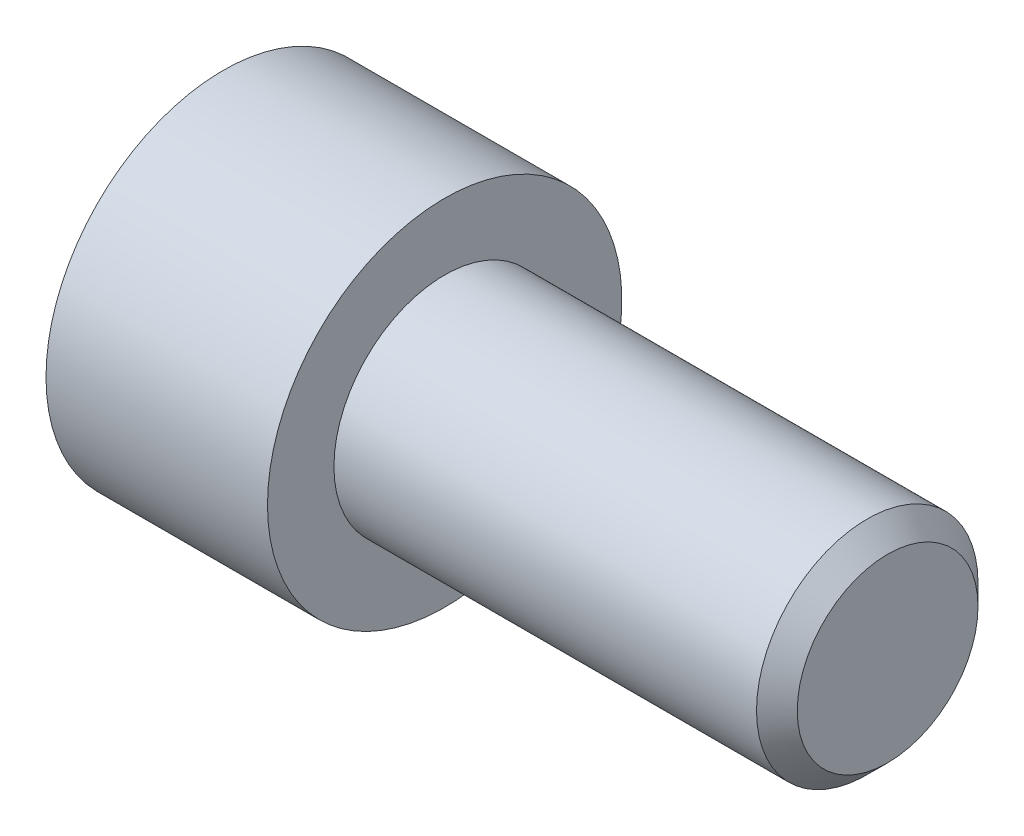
ISO-10303-21;
HEADER;
FILE_DESCRIPTION(('STEP AP214'),'2;1');
FILE_NAME('part.step','',(''),(''),'','','');
FILE_SCHEMA(('AUTOMOTIVE_DESIGN { 1 0 10303 214 1 1 1 1 }'));
ENDSEC;
DATA;
#1=APPLICATION_CONTEXT('core data for automotive mechanical design processes');
#2=APPLICATION_PROTOCOL_DEFINITION('international standard','automotive_design',2000,#1);
#3=PRODUCT_CONTEXT('',#1,'mechanical');
#4=PRODUCT('Part','Part','',(#3));
#5=PRODUCT_RELATED_PRODUCT_CATEGORY('part','',(#4));
#6=PRODUCT_DEFINITION_FORMATION('','',#4);
#7=PRODUCT_DEFINITION_CONTEXT('part definition',#1,'design');
#8=PRODUCT_DEFINITION('design','',#6,#7);
#9=PRODUCT_DEFINITION_SHAPE('','',#8);
#10=(LENGTH_UNIT() NAMED_UNIT(*) SI_UNIT(.MILLI.,.METRE.));
#11=(NAMED_UNIT(*) PLANE_ANGLE_UNIT() SI_UNIT($,.RADIAN.));
#12=(NAMED_UNIT(*) SI_UNIT($,.STERADIAN.) SOLID_ANGLE_UNIT());
#13=UNCERTAINTY_MEASURE_WITH_UNIT(LENGTH_MEASURE(1.E-05),#10,'distance_accuracy_value','');
#14=(GEOMETRIC_REPRESENTATION_CONTEXT(3) GLOBAL_UNCERTAINTY_ASSIGNED_CONTEXT((#13)) GLOBAL_UNIT_ASSIGNED_CONTEXT((#10,
#11,#12)) REPRESENTATION_CONTEXT('',''));
#15=CARTESIAN_POINT('',(0.,0.,0.));
#16=DIRECTION('',(0.,0.,1.));
#17=DIRECTION('',(1.,0.,0.));
#18=AXIS2_PLACEMENT_3D('',#15,#16,#17);
#19=CARTESIAN_POINT('',(-5.,2.3094010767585,4.));
#20=DIRECTION('',(1.,0.,0.));
#21=DIRECTION('',(0.,0.,-1.));
#22=AXIS2_PLACEMENT_3D('',#19,#20,#21);
#23=PLANE('',#22);
#24=DIRECTION('',(0.,-0.5,0.866025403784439));
#25=VECTOR('',#24,1.);
#26=CARTESIAN_POINT('',(-5.,4.61880215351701,0.));
#27=LINE('',#26,#25);
#28=CARTESIAN_POINT('',(-5.,4.61880215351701,0.));
#29=VERTEX_POINT('',#28);
#30=CARTESIAN_POINT('',(-5.,2.3094010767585,4.));
#31=VERTEX_POINT('',#30);
#32=EDGE_CURVE('E182',#29,#31,#27,.T.);
#33=ORIENTED_EDGE('',*,*,#32,.F.);
#34=DIRECTION('',(0.,0.5,0.866025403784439));
#35=VECTOR('',#34,1.);
#36=CARTESIAN_POINT('',(-5.,2.3094010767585,-4.));
#37=LINE('',#36,#35);
#38=CARTESIAN_POINT('',(-5.,2.3094010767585,-4.));
#39=VERTEX_POINT('',#38);
#40=EDGE_CURVE('E54',#39,#29,#37,.T.);
#41=ORIENTED_EDGE('',*,*,#40,.F.);
#42=DIRECTION('',(0.,1.,0.));
#43=VECTOR('',#42,1.);
#44=CARTESIAN_POINT('',(-5.,-2.3094010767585,-4.));
#45=LINE('',#44,#43);
#46=CARTESIAN_POINT('',(-5.,-2.3094010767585,-4.));
#47=VERTEX_POINT('',#46);
#48=EDGE_CURVE('E174',#47,#39,#45,.T.);
#49=ORIENTED_EDGE('',*,*,#48,.F.);
#50=DIRECTION('',(0.,0.5,-0.866025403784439));
#51=VECTOR('',#50,1.);
#52=CARTESIAN_POINT('',(-5.,-4.61880215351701,0.));
#53=LINE('',#52,#51);
#54=CARTESIAN_POINT('',(-5.,-4.61880215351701,0.));
#55=VERTEX_POINT('',#54);
#56=EDGE_CURVE('E176',#55,#47,#53,.T.);
#57=ORIENTED_EDGE('',*,*,#56,.F.);
#58=DIRECTION('',(0.,-0.5,-0.866025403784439));
#59=VECTOR('',#58,1.);
#60=CARTESIAN_POINT('',(-5.,-2.3094010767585,4.));
#61=LINE('',#60,#59);
#62=CARTESIAN_POINT('',(-5.,-2.3094010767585,4.));
#63=VERTEX_POINT('',#62);
#64=EDGE_CURVE('E178',#63,#55,#61,.T.);
#65=ORIENTED_EDGE('',*,*,#64,.F.);
#66=DIRECTION('',(0.,-1.,0.));
#67=VECTOR('',#66,1.);
#68=CARTESIAN_POINT('',(-5.,2.3094010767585,4.));
#69=LINE('',#68,#67);
#70=EDGE_CURVE('E180',#31,#63,#69,.T.);
#71=ORIENTED_EDGE('',*,*,#70,.F.);
#72=EDGE_LOOP('',(#33,#41,#49,#57,#65,#71));
#73=FACE_BOUND('',#72,.T.);
#74=CARTESIAN_POINT('',(-5.,0.,0.));
#75=DIRECTION('',(-1.,0.,0.));
#76=DIRECTION('',(0.,-1.,0.));
#77=AXIS2_PLACEMENT_3D('',#74,#75,#76);
#78=CIRCLE('',#77,3.99);
#79=CARTESIAN_POINT('',(-5.,-3.99,0.));
#80=VERTEX_POINT('',#79);
#81=EDGE_CURVE('E201',#80,#80,#78,.T.);
#82=ORIENTED_EDGE('',*,*,#81,.F.);
#83=EDGE_LOOP('',(#82));
#84=FACE_BOUND('',#83,.T.);
#85=ADVANCED_FACE('F32',(#73,#84),#23,.F.);
#86=CARTESIAN_POINT('',(-10.,0.,0.));
#87=DIRECTION('',(1.,0.,0.));
#88=DIRECTION('',(0.,0.,-1.));
#89=AXIS2_PLACEMENT_3D('',#86,#87,#88);
#90=PLANE('',#89);
#91=CARTESIAN_POINT('',(-10.,0.,0.));
#92=DIRECTION('',(-1.,0.,0.));
#93=DIRECTION('',(0.,0.,1.));
#94=AXIS2_PLACEMENT_3D('',#91,#92,#93);
#95=CIRCLE('',#94,8.);
#96=CARTESIAN_POINT('',(-10.,0.,8.));
#97=VERTEX_POINT('',#96);
#98=EDGE_CURVE('E11',#97,#97,#95,.T.);
#99=ORIENTED_EDGE('',*,*,#98,.T.);
#100=EDGE_LOOP('',(#99));
#101=FACE_BOUND('',#100,.T.);
#102=DIRECTION('',(0.,-0.5,0.866025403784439));
#103=VECTOR('',#102,1.);
#104=CARTESIAN_POINT('',(-10.,4.61880215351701,0.));
#105=LINE('',#104,#103);
#106=CARTESIAN_POINT('',(-10.,4.61880215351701,0.));
#107=VERTEX_POINT('',#106);
#108=CARTESIAN_POINT('',(-10.,2.3094010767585,4.));
#109=VERTEX_POINT('',#108);
#110=EDGE_CURVE('E47',#107,#109,#105,.T.);
#111=ORIENTED_EDGE('',*,*,#110,.T.);
#112=DIRECTION('',(0.,-1.,0.));
#113=VECTOR('',#112,1.);
#114=CARTESIAN_POINT('',(-10.,2.3094010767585,4.));
#115=LINE('',#114,#113);
#116=CARTESIAN_POINT('',(-10.,-2.3094010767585,4.));
#117=VERTEX_POINT('',#116);
#118=EDGE_CURVE('E197',#109,#117,#115,.T.);
#119=ORIENTED_EDGE('',*,*,#118,.T.);
#120=DIRECTION('',(0.,-0.5,-0.866025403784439));
#121=VECTOR('',#120,1.);
#122=CARTESIAN_POINT('',(-10.,-2.3094010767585,4.));
#123=LINE('',#122,#121);
#124=CARTESIAN_POINT('',(-10.,-4.61880215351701,0.));
#125=VERTEX_POINT('',#124);
#126=EDGE_CURVE('E194',#117,#125,#123,.T.);
#127=ORIENTED_EDGE('',*,*,#126,.T.);
#128=DIRECTION('',(0.,0.5,-0.866025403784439));
#129=VECTOR('',#128,1.);
#130=CARTESIAN_POINT('',(-10.,-4.61880215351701,0.));
#131=LINE('',#130,#129);
#132=CARTESIAN_POINT('',(-10.,-2.3094010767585,-4.));
#133=VERTEX_POINT('',#132);
#134=EDGE_CURVE('E191',#125,#133,#131,.T.);
#135=ORIENTED_EDGE('',*,*,#134,.T.);
#136=DIRECTION('',(0.,1.,0.));
#137=VECTOR('',#136,1.);
#138=CARTESIAN_POINT('',(-10.,-2.3094010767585,-4.));
#139=LINE('',#138,#137);
#140=CARTESIAN_POINT('',(-10.,2.3094010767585,-4.));
#141=VERTEX_POINT('',#140);
#142=EDGE_CURVE('E188',#133,#141,#139,.T.);
#143=ORIENTED_EDGE('',*,*,#142,.T.);
#144=DIRECTION('',(0.,0.5,0.866025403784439));
#145=VECTOR('',#144,1.);
#146=CARTESIAN_POINT('',(-10.,2.3094010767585,-4.));
#147=LINE('',#146,#145);
#148=EDGE_CURVE('E185',#141,#107,#147,.T.);
#149=ORIENTED_EDGE('',*,*,#148,.T.);
#150=EDGE_LOOP('',(#111,#119,#127,#135,#143,#149));
#151=FACE_BOUND('',#150,.T.);
#152=ADVANCED_FACE('F34',(#101,#151),#90,.F.);
#153=CARTESIAN_POINT('',(20.,0.,0.));
#154=DIRECTION('',(-1.,0.,0.));
#155=DIRECTION('',(0.,0.,1.));
#156=AXIS2_PLACEMENT_3D('',#153,#154,#155);
#157=CYLINDRICAL_SURFACE('',#156,8.);
#158=ORIENTED_EDGE('',*,*,#98,.F.);
#159=EDGE_LOOP('',(#158));
#160=FACE_BOUND('',#159,.T.);
#161=CARTESIAN_POINT('',(0.,0.,0.));
#162=DIRECTION('',(-1.,0.,0.));
#163=DIRECTION('',(0.,0.,1.));
#164=AXIS2_PLACEMENT_3D('',#161,#162,#163);
#165=CIRCLE('',#164,8.);
#166=CARTESIAN_POINT('',(0.,0.,8.));
#167=VERTEX_POINT('',#166);
#168=EDGE_CURVE('E40',#167,#167,#165,.T.);
#169=ORIENTED_EDGE('',*,*,#168,.T.);
#170=EDGE_LOOP('',(#169));
#171=FACE_BOUND('',#170,.T.);
#172=ADVANCED_FACE('F105',(#160,#171),#157,.T.);
#173=CARTESIAN_POINT('',(0.,8.,0.));
#174=DIRECTION('',(-1.,0.,0.));
#175=DIRECTION('',(0.,0.,1.));
#176=AXIS2_PLACEMENT_3D('',#173,#174,#175);
#177=PLANE('',#176);
#178=ORIENTED_EDGE('',*,*,#168,.F.);
#179=EDGE_LOOP('',(#178));
#180=FACE_BOUND('',#179,.T.);
#181=CARTESIAN_POINT('',(0.,0.,0.));
#182=DIRECTION('',(-1.,0.,0.));
#183=DIRECTION('',(0.,0.,1.));
#184=AXIS2_PLACEMENT_3D('',#181,#182,#183);
#185=CIRCLE('',#184,5.);
#186=CARTESIAN_POINT('',(0.,0.,5.));
#187=VERTEX_POINT('',#186);
#188=EDGE_CURVE('E151',#187,#187,#185,.T.);
#189=ORIENTED_EDGE('',*,*,#188,.T.);
#190=EDGE_LOOP('',(#189));
#191=FACE_BOUND('',#190,.T.);
#192=ADVANCED_FACE('F139',(#180,#191),#177,.F.);
#193=CARTESIAN_POINT('',(20.,0.,0.));
#194=DIRECTION('',(-1.,0.,0.));
#195=DIRECTION('',(0.,0.,1.));
#196=AXIS2_PLACEMENT_3D('',#193,#194,#195);
#197=CYLINDRICAL_SURFACE('',#196,5.);
#198=ORIENTED_EDGE('',*,*,#188,.F.);
#199=EDGE_LOOP('',(#198));
#200=FACE_BOUND('',#199,.T.);
#201=CARTESIAN_POINT('',(19.08,0.,0.));
#202=DIRECTION('',(-1.,0.,0.));
#203=DIRECTION('',(0.,0.,1.));
#204=AXIS2_PLACEMENT_3D('',#201,#202,#203);
#205=CIRCLE('',#204,5.);
#206=CARTESIAN_POINT('',(19.08,0.,5.));
#207=VERTEX_POINT('',#206);
#208=EDGE_CURVE('E153',#207,#207,#205,.T.);
#209=ORIENTED_EDGE('',*,*,#208,.T.);
#210=EDGE_LOOP('',(#209));
#211=FACE_BOUND('',#210,.T.);
#212=ADVANCED_FACE('F135',(#200,#211),#197,.T.);
#213=CARTESIAN_POINT('',(20.,0.,0.));
#214=DIRECTION('',(-1.,0.,0.));
#215=DIRECTION('',(0.,0.,1.));
#216=AXIS2_PLACEMENT_3D('',#213,#214,#215);
#217=CONICAL_SURFACE('',#216,4.08,0.785398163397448);
#218=ORIENTED_EDGE('',*,*,#208,.F.);
#219=EDGE_LOOP('',(#218));
#220=FACE_BOUND('',#219,.T.);
#221=CARTESIAN_POINT('',(20.,0.,0.));
#222=DIRECTION('',(-1.,0.,0.));
#223=DIRECTION('',(0.,0.,1.));
#224=AXIS2_PLACEMENT_3D('',#221,#222,#223);
#225=CIRCLE('',#224,4.08);
#226=CARTESIAN_POINT('',(20.,0.,4.08));
#227=VERTEX_POINT('',#226);
#228=EDGE_CURVE('E158',#227,#227,#225,.T.);
#229=ORIENTED_EDGE('',*,*,#228,.T.);
#230=EDGE_LOOP('',(#229));
#231=FACE_BOUND('',#230,.T.);
#232=ADVANCED_FACE('F131',(#220,#231),#217,.T.);
#233=CARTESIAN_POINT('',(20.,4.08,0.));
#234=DIRECTION('',(-1.,0.,0.));
#235=DIRECTION('',(0.,0.,1.));
#236=AXIS2_PLACEMENT_3D('',#233,#234,#235);
#237=PLANE('',#236);
#238=ORIENTED_EDGE('',*,*,#228,.F.);
#239=EDGE_LOOP('',(#238));
#240=FACE_BOUND('',#239,.T.);
#241=ADVANCED_FACE('F128',(#240),#237,.F.);
#242=CARTESIAN_POINT('',(-5.,4.61880215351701,0.));
#243=DIRECTION('',(0.,-0.866025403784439,-0.5));
#244=DIRECTION('',(0.,0.5,-0.866025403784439));
#245=AXIS2_PLACEMENT_3D('',#242,#243,#244);
#246=PLANE('',#245);
#247=ORIENTED_EDGE('',*,*,#110,.F.);
#248=DIRECTION('',(-1.,0.,0.));
#249=VECTOR('',#248,1.);
#250=CARTESIAN_POINT('',(-5.,4.61880215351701,0.));
#251=LINE('',#250,#249);
#252=EDGE_CURVE('E171',#29,#107,#251,.T.);
#253=ORIENTED_EDGE('',*,*,#252,.F.);
#254=ORIENTED_EDGE('',*,*,#32,.T.);
#255=DIRECTION('',(-1.,0.,0.));
#256=VECTOR('',#255,1.);
#257=CARTESIAN_POINT('',(-5.,2.3094010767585,4.));
#258=LINE('',#257,#256);
#259=EDGE_CURVE('E161',#31,#109,#258,.T.);
#260=ORIENTED_EDGE('',*,*,#259,.T.);
#261=EDGE_LOOP('',(#247,#253,#254,#260));
#262=FACE_BOUND('',#261,.T.);
#263=ADVANCED_FACE('F124',(#262),#246,.T.);
#264=CARTESIAN_POINT('',(-5.,2.3094010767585,4.));
#265=DIRECTION('',(0.,0.,-1.));
#266=DIRECTION('',(-1.,0.,0.));
#267=AXIS2_PLACEMENT_3D('',#264,#265,#266);
#268=PLANE('',#267);
#269=ORIENTED_EDGE('',*,*,#118,.F.);
#270=ORIENTED_EDGE('',*,*,#259,.F.);
#271=ORIENTED_EDGE('',*,*,#70,.T.);
#272=DIRECTION('',(-1.,0.,0.));
#273=VECTOR('',#272,1.);
#274=CARTESIAN_POINT('',(-5.,-2.3094010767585,4.));
#275=LINE('',#274,#273);
#276=EDGE_CURVE('E163',#63,#117,#275,.T.);
#277=ORIENTED_EDGE('',*,*,#276,.T.);
#278=EDGE_LOOP('',(#269,#270,#271,#277));
#279=FACE_BOUND('',#278,.T.);
#280=ADVANCED_FACE('F120',(#279),#268,.T.);
#281=CARTESIAN_POINT('',(-5.,-2.3094010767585,4.));
#282=DIRECTION('',(0.,0.866025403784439,-0.5));
#283=DIRECTION('',(0.,0.5,0.866025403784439));
#284=AXIS2_PLACEMENT_3D('',#281,#282,#283);
#285=PLANE('',#284);
#286=ORIENTED_EDGE('',*,*,#126,.F.);
#287=ORIENTED_EDGE('',*,*,#276,.F.);
#288=ORIENTED_EDGE('',*,*,#64,.T.);
#289=DIRECTION('',(-1.,0.,0.));
#290=VECTOR('',#289,1.);
#291=CARTESIAN_POINT('',(-5.,-4.61880215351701,0.));
#292=LINE('',#291,#290);
#293=EDGE_CURVE('E165',#55,#125,#292,.T.);
#294=ORIENTED_EDGE('',*,*,#293,.T.);
#295=EDGE_LOOP('',(#286,#287,#288,#294));
#296=FACE_BOUND('',#295,.T.);
#297=ADVANCED_FACE('F116',(#296),#285,.T.);
#298=CARTESIAN_POINT('',(-5.,-4.61880215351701,0.));
#299=DIRECTION('',(0.,0.866025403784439,0.5));
#300=DIRECTION('',(0.,-0.5,0.866025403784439));
#301=AXIS2_PLACEMENT_3D('',#298,#299,#300);
#302=PLANE('',#301);
#303=ORIENTED_EDGE('',*,*,#134,.F.);
#304=ORIENTED_EDGE('',*,*,#293,.F.);
#305=ORIENTED_EDGE('',*,*,#56,.T.);
#306=DIRECTION('',(-1.,0.,0.));
#307=VECTOR('',#306,1.);
#308=CARTESIAN_POINT('',(-5.,-2.3094010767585,-4.));
#309=LINE('',#308,#307);
#310=EDGE_CURVE('E167',#47,#133,#309,.T.);
#311=ORIENTED_EDGE('',*,*,#310,.T.);
#312=EDGE_LOOP('',(#303,#304,#305,#311));
#313=FACE_BOUND('',#312,.T.);
#314=ADVANCED_FACE('F112',(#313),#302,.T.);
#315=CARTESIAN_POINT('',(-5.,-2.3094010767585,-4.));
#316=DIRECTION('',(0.,0.,1.));
#317=DIRECTION('',(1.,0.,0.));
#318=AXIS2_PLACEMENT_3D('',#315,#316,#317);
#319=PLANE('',#318);
#320=ORIENTED_EDGE('',*,*,#142,.F.);
#321=ORIENTED_EDGE('',*,*,#310,.F.);
#322=ORIENTED_EDGE('',*,*,#48,.T.);
#323=DIRECTION('',(-1.,0.,0.));
#324=VECTOR('',#323,1.);
#325=CARTESIAN_POINT('',(-5.,2.3094010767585,-4.));
#326=LINE('',#325,#324);
#327=EDGE_CURVE('E169',#39,#141,#326,.T.);
#328=ORIENTED_EDGE('',*,*,#327,.T.);
#329=EDGE_LOOP('',(#320,#321,#322,#328));
#330=FACE_BOUND('',#329,.T.);
#331=ADVANCED_FACE('F96',(#330),#319,.T.);
#332=CARTESIAN_POINT('',(-5.,2.3094010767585,-4.));
#333=DIRECTION('',(0.,-0.866025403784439,0.5));
#334=DIRECTION('',(0.,-0.5,-0.866025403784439));
#335=AXIS2_PLACEMENT_3D('',#332,#333,#334);
#336=PLANE('',#335);
#337=ORIENTED_EDGE('',*,*,#148,.F.);
#338=ORIENTED_EDGE('',*,*,#327,.F.);
#339=ORIENTED_EDGE('',*,*,#40,.T.);
#340=ORIENTED_EDGE('',*,*,#252,.T.);
#341=EDGE_LOOP('',(#337,#338,#339,#340));
#342=FACE_BOUND('',#341,.T.);
#343=ADVANCED_FACE('F90',(#342),#336,.T.);
#344=CARTESIAN_POINT('',(-2.69637242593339,0.,0.));
#345=DIRECTION('',(-1.,0.,0.));
#346=DIRECTION('',(0.,-1.,0.));
#347=AXIS2_PLACEMENT_3D('',#344,#345,#346);
#348=CONICAL_SURFACE('',#347,0.,1.0471975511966);
#349=ORIENTED_EDGE('',*,*,#81,.T.);
#350=EDGE_LOOP('',(#349));
#351=FACE_BOUND('',#350,.T.);
#352=CARTESIAN_POINT('',(-2.69637242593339,0.,0.));
#353=VERTEX_POINT('',#352);
#354=VERTEX_LOOP('',#353);
#355=FACE_BOUND('',#354,.T.);
#356=ADVANCED_FACE('F88',(#351,#355),#348,.F.);
#357=CLOSED_SHELL('',(#85,#152,#172,#192,#212,#232,#241,#263,#280,#297,#314,#331,#343,#356));
#358=MANIFOLD_SOLID_BREP('B2',#357);
#359=ADVANCED_BREP_SHAPE_REPRESENTATION('',(#18,#358),#14);
#360=SHAPE_DEFINITION_REPRESENTATION(#9,#359);
ENDSEC;
END-ISO-10303-21;
